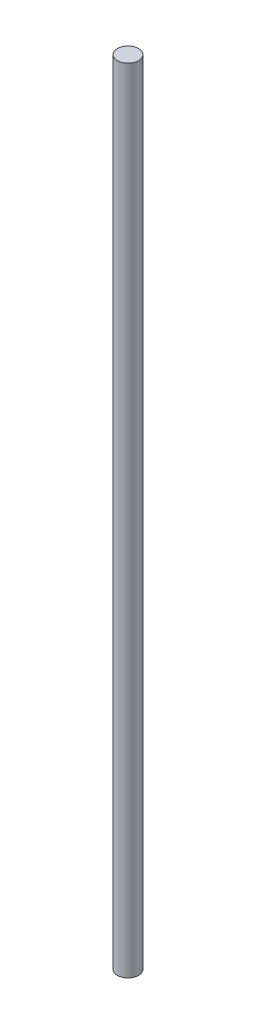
ISO-10303-21;
HEADER;
FILE_DESCRIPTION(('STEP AP214'),'2;1');
FILE_NAME('part.step','',(''),(''),'','','');
FILE_SCHEMA(('AUTOMOTIVE_DESIGN { 1 0 10303 214 1 1 1 1 }'));
ENDSEC;
DATA;
#1=APPLICATION_CONTEXT('core data for automotive mechanical design processes');
#2=APPLICATION_PROTOCOL_DEFINITION('international standard','automotive_design',2000,#1);
#3=PRODUCT_CONTEXT('',#1,'mechanical');
#4=PRODUCT('Part','Part','',(#3));
#5=PRODUCT_RELATED_PRODUCT_CATEGORY('part','',(#4));
#6=PRODUCT_DEFINITION_FORMATION('','',#4);
#7=PRODUCT_DEFINITION_CONTEXT('part definition',#1,'design');
#8=PRODUCT_DEFINITION('design','',#6,#7);
#9=PRODUCT_DEFINITION_SHAPE('','',#8);
#10=(LENGTH_UNIT() NAMED_UNIT(*) SI_UNIT(.MILLI.,.METRE.));
#11=(NAMED_UNIT(*) PLANE_ANGLE_UNIT() SI_UNIT($,.RADIAN.));
#12=(NAMED_UNIT(*) SI_UNIT($,.STERADIAN.) SOLID_ANGLE_UNIT());
#13=UNCERTAINTY_MEASURE_WITH_UNIT(LENGTH_MEASURE(1.E-05),#10,'distance_accuracy_value','');
#14=(GEOMETRIC_REPRESENTATION_CONTEXT(3) GLOBAL_UNCERTAINTY_ASSIGNED_CONTEXT((#13)) GLOBAL_UNIT_ASSIGNED_CONTEXT((#10,
#11,#12)) REPRESENTATION_CONTEXT('',''));
#15=CARTESIAN_POINT('',(0.,0.,0.));
#16=DIRECTION('',(0.,0.,1.));
#17=DIRECTION('',(1.,0.,0.));
#18=AXIS2_PLACEMENT_3D('',#15,#16,#17);
#19=CARTESIAN_POINT('',(0.,300.,0.));
#20=DIRECTION('',(0.,1.,0.));
#21=DIRECTION('',(0.,0.,1.));
#22=AXIS2_PLACEMENT_3D('',#19,#20,#21);
#23=PLANE('',#22);
#24=CARTESIAN_POINT('',(0.,300.,0.));
#25=DIRECTION('',(0.,-1.,0.));
#26=DIRECTION('',(0.,0.,-1.));
#27=AXIS2_PLACEMENT_3D('',#24,#25,#26);
#28=CIRCLE('',#27,4.);
#29=CARTESIAN_POINT('',(0.,300.,-4.));
#30=VERTEX_POINT('',#29);
#31=EDGE_CURVE('E10',#30,#30,#28,.T.);
#32=ORIENTED_EDGE('',*,*,#31,.F.);
#33=EDGE_LOOP('',(#32));
#34=FACE_BOUND('',#33,.T.);
#35=ADVANCED_FACE('F43',(#34),#23,.T.);
#36=CARTESIAN_POINT('',(0.,0.,0.));
#37=DIRECTION('',(0.,-1.,0.));
#38=DIRECTION('',(0.,0.,-1.));
#39=AXIS2_PLACEMENT_3D('',#36,#37,#38);
#40=CYLINDRICAL_SURFACE('',#39,4.);
#41=ORIENTED_EDGE('',*,*,#31,.T.);
#42=EDGE_LOOP('',(#41));
#43=FACE_BOUND('',#42,.T.);
#44=CARTESIAN_POINT('',(0.,0.,0.));
#45=DIRECTION('',(0.,-1.,0.));
#46=DIRECTION('',(0.,0.,-1.));
#47=AXIS2_PLACEMENT_3D('',#44,#45,#46);
#48=CIRCLE('',#47,4.);
#49=CARTESIAN_POINT('',(0.,0.,-4.));
#50=VERTEX_POINT('',#49);
#51=EDGE_CURVE('E50',#50,#50,#48,.T.);
#52=ORIENTED_EDGE('',*,*,#51,.F.);
#53=EDGE_LOOP('',(#52));
#54=FACE_BOUND('',#53,.T.);
#55=ADVANCED_FACE('F59',(#43,#54),#40,.T.);
#56=CARTESIAN_POINT('',(0.,0.,0.));
#57=DIRECTION('',(0.,-1.,0.));
#58=DIRECTION('',(0.,0.,-1.));
#59=AXIS2_PLACEMENT_3D('',#56,#57,#58);
#60=PLANE('',#59);
#61=ORIENTED_EDGE('',*,*,#51,.T.);
#62=EDGE_LOOP('',(#61));
#63=FACE_BOUND('',#62,.T.);
#64=ADVANCED_FACE('F57',(#63),#60,.T.);
#65=CLOSED_SHELL('',(#35,#55,#64));
#66=MANIFOLD_SOLID_BREP('B2',#65);
#67=ADVANCED_BREP_SHAPE_REPRESENTATION('',(#18,#66),#14);
#68=SHAPE_DEFINITION_REPRESENTATION(#9,#67);
ENDSEC;
END-ISO-10303-21;
